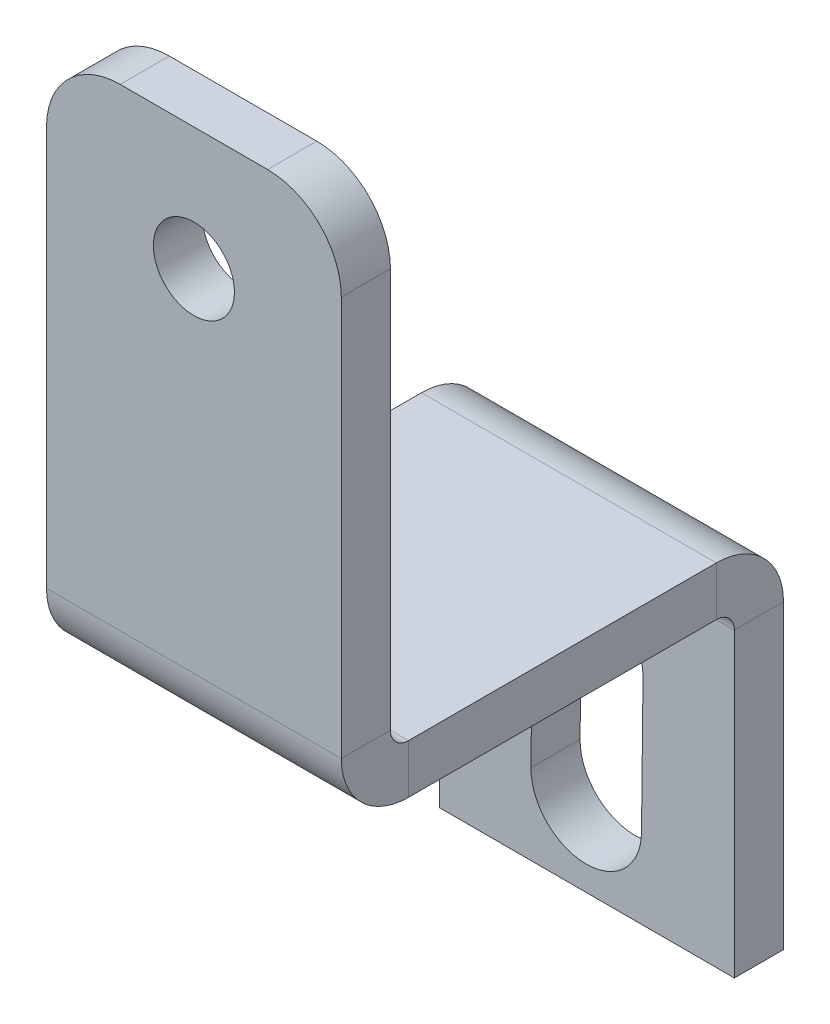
ISO-10303-21;
HEADER;
FILE_DESCRIPTION(('STEP AP214'),'2;1');
FILE_NAME('part.step','',(''),(''),'','','');
FILE_SCHEMA(('AUTOMOTIVE_DESIGN { 1 0 10303 214 1 1 1 1 }'));
ENDSEC;
DATA;
#1=APPLICATION_CONTEXT('core data for automotive mechanical design processes');
#2=APPLICATION_PROTOCOL_DEFINITION('international standard','automotive_design',2000,#1);
#3=PRODUCT_CONTEXT('',#1,'mechanical');
#4=PRODUCT('Part','Part','',(#3));
#5=PRODUCT_RELATED_PRODUCT_CATEGORY('part','',(#4));
#6=PRODUCT_DEFINITION_FORMATION('','',#4);
#7=PRODUCT_DEFINITION_CONTEXT('part definition',#1,'design');
#8=PRODUCT_DEFINITION('design','',#6,#7);
#9=PRODUCT_DEFINITION_SHAPE('','',#8);
#10=(LENGTH_UNIT() NAMED_UNIT(*) SI_UNIT(.MILLI.,.METRE.));
#11=(NAMED_UNIT(*) PLANE_ANGLE_UNIT() SI_UNIT($,.RADIAN.));
#12=(NAMED_UNIT(*) SI_UNIT($,.STERADIAN.) SOLID_ANGLE_UNIT());
#13=UNCERTAINTY_MEASURE_WITH_UNIT(LENGTH_MEASURE(1.E-05),#10,'distance_accuracy_value','');
#14=(GEOMETRIC_REPRESENTATION_CONTEXT(3) GLOBAL_UNCERTAINTY_ASSIGNED_CONTEXT((#13)) GLOBAL_UNIT_ASSIGNED_CONTEXT((#10,
#11,#12)) REPRESENTATION_CONTEXT('',''));
#15=CARTESIAN_POINT('',(0.,0.,0.));
#16=DIRECTION('',(0.,0.,1.));
#17=DIRECTION('',(1.,0.,0.));
#18=AXIS2_PLACEMENT_3D('',#15,#16,#17);
#19=CARTESIAN_POINT('',(-32.4679437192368,11.6094189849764,0.));
#20=DIRECTION('',(-1.,0.,0.));
#21=DIRECTION('',(0.,0.,1.));
#22=AXIS2_PLACEMENT_3D('',#19,#20,#21);
#23=PLANE('',#22);
#24=DIRECTION('',(0.,-1.,0.));
#25=VECTOR('',#24,1.);
#26=CARTESIAN_POINT('',(-32.4679437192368,11.6094189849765,13.2634));
#27=LINE('',#26,#25);
#28=CARTESIAN_POINT('',(-32.4679437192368,11.6094189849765,13.2634));
#29=VERTEX_POINT('',#28);
#30=CARTESIAN_POINT('',(-32.4679437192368,9.60941898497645,13.2634));
#31=VERTEX_POINT('',#30);
#32=EDGE_CURVE('E213',#29,#31,#27,.T.);
#33=ORIENTED_EDGE('',*,*,#32,.T.);
#34=DIRECTION('',(0.,0.,1.));
#35=VECTOR('',#34,1.);
#36=CARTESIAN_POINT('',(-32.4679437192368,9.6094189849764,0.));
#37=LINE('',#36,#35);
#38=CARTESIAN_POINT('',(-32.4679437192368,9.6094189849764,0.7366));
#39=VERTEX_POINT('',#38);
#40=EDGE_CURVE('E238',#31,#39,#37,.F.);
#41=ORIENTED_EDGE('',*,*,#40,.T.);
#42=DIRECTION('',(0.,-1.,0.));
#43=VECTOR('',#42,1.);
#44=CARTESIAN_POINT('',(-32.4679437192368,11.6094189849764,0.73659999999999));
#45=LINE('',#44,#43);
#46=CARTESIAN_POINT('',(-32.4679437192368,11.6094189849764,0.73659999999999));
#47=VERTEX_POINT('',#46);
#48=EDGE_CURVE('E226',#39,#47,#45,.F.);
#49=ORIENTED_EDGE('',*,*,#48,.T.);
#50=DIRECTION('',(0.,0.,-1.));
#51=VECTOR('',#50,1.);
#52=CARTESIAN_POINT('',(-32.4679437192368,11.6094189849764,0.));
#53=LINE('',#52,#51);
#54=EDGE_CURVE('E233',#29,#47,#53,.T.);
#55=ORIENTED_EDGE('',*,*,#54,.F.);
#56=EDGE_LOOP('',(#33,#41,#49,#55));
#57=FACE_BOUND('',#56,.T.);
#58=ADVANCED_FACE('F16',(#57),#23,.F.);
#59=CARTESIAN_POINT('',(-44.4679437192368,11.6094189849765,16.));
#60=DIRECTION('',(1.,0.,0.));
#61=DIRECTION('',(0.,0.,-1.));
#62=AXIS2_PLACEMENT_3D('',#59,#60,#61);
#63=PLANE('',#62);
#64=DIRECTION('',(0.,-1.,0.));
#65=VECTOR('',#64,1.);
#66=CARTESIAN_POINT('',(-44.4679437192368,11.6094189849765,13.2634));
#67=LINE('',#66,#65);
#68=CARTESIAN_POINT('',(-44.4679437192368,11.6094189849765,13.2634));
#69=VERTEX_POINT('',#68);
#70=CARTESIAN_POINT('',(-44.4679437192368,9.60941898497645,13.2634));
#71=VERTEX_POINT('',#70);
#72=EDGE_CURVE('E223',#69,#71,#67,.T.);
#73=ORIENTED_EDGE('',*,*,#72,.F.);
#74=DIRECTION('',(0.,0.,1.));
#75=VECTOR('',#74,1.);
#76=CARTESIAN_POINT('',(-44.4679437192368,11.6094189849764,0.));
#77=LINE('',#76,#75);
#78=CARTESIAN_POINT('',(-44.4679437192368,11.6094189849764,0.73659999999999));
#79=VERTEX_POINT('',#78);
#80=EDGE_CURVE('E229',#79,#69,#77,.T.);
#81=ORIENTED_EDGE('',*,*,#80,.F.);
#82=DIRECTION('',(0.,-1.,0.));
#83=VECTOR('',#82,1.);
#84=CARTESIAN_POINT('',(-44.4679437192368,9.6094189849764,0.7366));
#85=LINE('',#84,#83);
#86=CARTESIAN_POINT('',(-44.4679437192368,9.6094189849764,0.7366));
#87=VERTEX_POINT('',#86);
#88=EDGE_CURVE('E243',#87,#79,#85,.F.);
#89=ORIENTED_EDGE('',*,*,#88,.F.);
#90=DIRECTION('',(0.,0.,-1.));
#91=VECTOR('',#90,1.);
#92=CARTESIAN_POINT('',(-44.4679437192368,9.60941898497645,16.));
#93=LINE('',#92,#91);
#94=EDGE_CURVE('E235',#87,#71,#93,.F.);
#95=ORIENTED_EDGE('',*,*,#94,.T.);
#96=EDGE_LOOP('',(#73,#81,#89,#95));
#97=FACE_BOUND('',#96,.T.);
#98=ADVANCED_FACE('F354',(#97),#63,.F.);
#99=CARTESIAN_POINT('',(0.,11.6094189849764,0.));
#100=DIRECTION('',(0.,-1.,0.));
#101=DIRECTION('',(0.,0.,-1.));
#102=AXIS2_PLACEMENT_3D('',#99,#100,#101);
#103=PLANE('',#102);
#104=DIRECTION('',(1.,0.,0.));
#105=VECTOR('',#104,1.);
#106=CARTESIAN_POINT('',(-32.4679437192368,11.6094189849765,13.2634));
#107=LINE('',#106,#105);
#108=EDGE_CURVE('E219',#29,#69,#107,.F.);
#109=ORIENTED_EDGE('',*,*,#108,.F.);
#110=ORIENTED_EDGE('',*,*,#54,.T.);
#111=DIRECTION('',(-1.,0.,0.));
#112=VECTOR('',#111,1.);
#113=CARTESIAN_POINT('',(-32.4679437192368,11.6094189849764,0.73659999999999));
#114=LINE('',#113,#112);
#115=EDGE_CURVE('E240',#79,#47,#114,.F.);
#116=ORIENTED_EDGE('',*,*,#115,.F.);
#117=ORIENTED_EDGE('',*,*,#80,.T.);
#118=EDGE_LOOP('',(#109,#110,#116,#117));
#119=FACE_BOUND('',#118,.T.);
#120=ADVANCED_FACE('F362',(#119),#103,.F.);
#121=CARTESIAN_POINT('',(0.,9.6094189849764,0.));
#122=DIRECTION('',(0.,-1.,0.));
#123=DIRECTION('',(0.,0.,-1.));
#124=AXIS2_PLACEMENT_3D('',#121,#122,#123);
#125=PLANE('',#124);
#126=ORIENTED_EDGE('',*,*,#40,.F.);
#127=DIRECTION('',(1.,0.,0.));
#128=VECTOR('',#127,1.);
#129=CARTESIAN_POINT('',(-32.4679437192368,9.60941898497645,13.2634));
#130=LINE('',#129,#128);
#131=EDGE_CURVE('E206',#31,#71,#130,.F.);
#132=ORIENTED_EDGE('',*,*,#131,.T.);
#133=ORIENTED_EDGE('',*,*,#94,.F.);
#134=DIRECTION('',(-1.,0.,0.));
#135=VECTOR('',#134,1.);
#136=CARTESIAN_POINT('',(-32.4679437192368,9.6094189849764,0.7366));
#137=LINE('',#136,#135);
#138=EDGE_CURVE('E246',#39,#87,#137,.T.);
#139=ORIENTED_EDGE('',*,*,#138,.F.);
#140=EDGE_LOOP('',(#126,#132,#133,#139));
#141=FACE_BOUND('',#140,.T.);
#142=ADVANCED_FACE('F351',(#141),#125,.T.);
#143=CARTESIAN_POINT('',(-44.4679437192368,11.6094189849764,-2.));
#144=DIRECTION('',(-1.,0.,0.));
#145=DIRECTION('',(0.,0.,1.));
#146=AXIS2_PLACEMENT_3D('',#143,#144,#145);
#147=PLANE('',#146);
#148=DIRECTION('',(0.,-1.,0.));
#149=VECTOR('',#148,1.);
#150=CARTESIAN_POINT('',(-44.4679437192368,11.6094189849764,0.));
#151=LINE('',#150,#149);
#152=CARTESIAN_POINT('',(-44.4679437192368,8.8728189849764,0.));
#153=VERTEX_POINT('',#152);
#154=CARTESIAN_POINT('',(-44.4679437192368,-3.3905810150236,0.));
#155=VERTEX_POINT('',#154);
#156=EDGE_CURVE('E270',#153,#155,#151,.T.);
#157=ORIENTED_EDGE('',*,*,#156,.F.);
#158=DIRECTION('',(0.,0.,-1.));
#159=VECTOR('',#158,1.);
#160=CARTESIAN_POINT('',(-44.4679437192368,8.8728189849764,0.));
#161=LINE('',#160,#159);
#162=CARTESIAN_POINT('',(-44.4679437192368,8.8728189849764,-2.));
#163=VERTEX_POINT('',#162);
#164=EDGE_CURVE('E256',#153,#163,#161,.T.);
#165=ORIENTED_EDGE('',*,*,#164,.T.);
#166=DIRECTION('',(0.,-1.,0.));
#167=VECTOR('',#166,1.);
#168=CARTESIAN_POINT('',(-44.4679437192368,11.6094189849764,-2.));
#169=LINE('',#168,#167);
#170=CARTESIAN_POINT('',(-44.4679437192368,-3.3905810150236,-2.));
#171=VERTEX_POINT('',#170);
#172=EDGE_CURVE('E273',#163,#171,#169,.T.);
#173=ORIENTED_EDGE('',*,*,#172,.T.);
#174=DIRECTION('',(0.,0.,1.));
#175=VECTOR('',#174,1.);
#176=CARTESIAN_POINT('',(-44.4679437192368,-3.3905810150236,-2.));
#177=LINE('',#176,#175);
#178=EDGE_CURVE('E282',#171,#155,#177,.T.);
#179=ORIENTED_EDGE('',*,*,#178,.T.);
#180=EDGE_LOOP('',(#157,#165,#173,#179));
#181=FACE_BOUND('',#180,.T.);
#182=ADVANCED_FACE('F409',(#181),#147,.T.);
#183=CARTESIAN_POINT('',(0.,0.,-2.));
#184=DIRECTION('',(0.,0.,1.));
#185=DIRECTION('',(1.,0.,0.));
#186=AXIS2_PLACEMENT_3D('',#183,#184,#185);
#187=PLANE('',#186);
#188=CARTESIAN_POINT('',(-38.4370642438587,5.35924560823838,-2.));
#189=DIRECTION('',(0.,0.,1.));
#190=DIRECTION('',(1.,0.,0.));
#191=AXIS2_PLACEMENT_3D('',#188,#189,#190);
#192=CIRCLE('',#191,2.25);
#193=CARTESIAN_POINT('',(-36.1872060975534,5.33398058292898,-2.));
#194=VERTEX_POINT('',#193);
#195=CARTESIAN_POINT('',(-40.6869223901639,5.38451063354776,-2.));
#196=VERTEX_POINT('',#195);
#197=EDGE_CURVE('E169',#194,#196,#192,.T.);
#198=ORIENTED_EDGE('',*,*,#197,.T.);
#199=DIRECTION('',(0.011228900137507,0.999936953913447,0.));
#200=VECTOR('',#199,1.);
#201=CARTESIAN_POINT('',(-40.7486813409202,-0.115142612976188,-2.));
#202=LINE('',#201,#200);
#203=CARTESIAN_POINT('',(-40.7486813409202,-0.115142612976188,-2.));
#204=VERTEX_POINT('',#203);
#205=EDGE_CURVE('E150',#204,#196,#202,.T.);
#206=ORIENTED_EDGE('',*,*,#205,.F.);
#207=CARTESIAN_POINT('',(-38.4988231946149,-0.140407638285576,-2.));
#208=DIRECTION('',(0.,0.,1.));
#209=DIRECTION('',(1.,0.,0.));
#210=AXIS2_PLACEMENT_3D('',#207,#208,#209);
#211=CIRCLE('',#210,2.25);
#212=CARTESIAN_POINT('',(-36.2489650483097,-0.165672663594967,-2.));
#213=VERTEX_POINT('',#212);
#214=EDGE_CURVE('E154',#204,#213,#211,.T.);
#215=ORIENTED_EDGE('',*,*,#214,.T.);
#216=DIRECTION('',(0.011228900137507,0.999936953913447,0.));
#217=VECTOR('',#216,1.);
#218=CARTESIAN_POINT('',(-36.2489650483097,-0.165672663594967,-2.));
#219=LINE('',#218,#217);
#220=EDGE_CURVE('E686',#213,#194,#219,.T.);
#221=ORIENTED_EDGE('',*,*,#220,.T.);
#222=EDGE_LOOP('',(#198,#206,#215,#221));
#223=FACE_BOUND('',#222,.T.);
#224=DIRECTION('',(-1.,0.,0.));
#225=VECTOR('',#224,1.);
#226=CARTESIAN_POINT('',(-44.4679437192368,8.8728189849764,-2.));
#227=LINE('',#226,#225);
#228=CARTESIAN_POINT('',(-32.4679437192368,8.87281898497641,-2.));
#229=VERTEX_POINT('',#228);
#230=EDGE_CURVE('E250',#163,#229,#227,.F.);
#231=ORIENTED_EDGE('',*,*,#230,.T.);
#232=DIRECTION('',(0.,1.,0.));
#233=VECTOR('',#232,1.);
#234=CARTESIAN_POINT('',(-32.4679437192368,11.6094189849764,-2.));
#235=LINE('',#234,#233);
#236=CARTESIAN_POINT('',(-32.4679437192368,-3.3905810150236,-2.));
#237=VERTEX_POINT('',#236);
#238=EDGE_CURVE('E279',#237,#229,#235,.T.);
#239=ORIENTED_EDGE('',*,*,#238,.F.);
#240=DIRECTION('',(1.,0.,0.));
#241=VECTOR('',#240,1.);
#242=CARTESIAN_POINT('',(-44.4679437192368,-3.3905810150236,-2.));
#243=LINE('',#242,#241);
#244=EDGE_CURVE('E275',#171,#237,#243,.T.);
#245=ORIENTED_EDGE('',*,*,#244,.F.);
#246=ORIENTED_EDGE('',*,*,#172,.F.);
#247=EDGE_LOOP('',(#231,#239,#245,#246));
#248=FACE_BOUND('',#247,.T.);
#249=ADVANCED_FACE('F406',(#223,#248),#187,.F.);
#250=CARTESIAN_POINT('',(0.,0.,0.));
#251=DIRECTION('',(0.,0.,1.));
#252=DIRECTION('',(1.,0.,0.));
#253=AXIS2_PLACEMENT_3D('',#250,#251,#252);
#254=PLANE('',#253);
#255=DIRECTION('',(0.011228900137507,0.999936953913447,0.));
#256=VECTOR('',#255,1.);
#257=CARTESIAN_POINT('',(-40.7486813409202,-0.115142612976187,0.));
#258=LINE('',#257,#256);
#259=CARTESIAN_POINT('',(-40.7486813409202,-0.115142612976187,0.));
#260=VERTEX_POINT('',#259);
#261=CARTESIAN_POINT('',(-40.6869223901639,5.38451063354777,0.));
#262=VERTEX_POINT('',#261);
#263=EDGE_CURVE('E141',#260,#262,#258,.T.);
#264=ORIENTED_EDGE('',*,*,#263,.T.);
#265=CARTESIAN_POINT('',(-38.4370642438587,5.35924560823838,0.));
#266=DIRECTION('',(0.,0.,1.));
#267=DIRECTION('',(1.,0.,0.));
#268=AXIS2_PLACEMENT_3D('',#265,#266,#267);
#269=CIRCLE('',#268,2.25);
#270=CARTESIAN_POINT('',(-36.1872060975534,5.33398058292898,0.));
#271=VERTEX_POINT('',#270);
#272=EDGE_CURVE('E156',#271,#262,#269,.T.);
#273=ORIENTED_EDGE('',*,*,#272,.F.);
#274=DIRECTION('',(0.011228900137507,0.999936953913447,0.));
#275=VECTOR('',#274,1.);
#276=CARTESIAN_POINT('',(-36.2489650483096,-0.165672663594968,0.));
#277=LINE('',#276,#275);
#278=CARTESIAN_POINT('',(-36.2489650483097,-0.165672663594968,0.));
#279=VERTEX_POINT('',#278);
#280=EDGE_CURVE('E162',#279,#271,#277,.T.);
#281=ORIENTED_EDGE('',*,*,#280,.F.);
#282=CARTESIAN_POINT('',(-38.4988231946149,-0.140407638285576,0.));
#283=DIRECTION('',(0.,0.,1.));
#284=DIRECTION('',(1.,0.,0.));
#285=AXIS2_PLACEMENT_3D('',#282,#283,#284);
#286=CIRCLE('',#285,2.25);
#287=EDGE_CURVE('E39',#260,#279,#286,.T.);
#288=ORIENTED_EDGE('',*,*,#287,.F.);
#289=EDGE_LOOP('',(#264,#273,#281,#288));
#290=FACE_BOUND('',#289,.T.);
#291=DIRECTION('',(0.,1.,0.));
#292=VECTOR('',#291,1.);
#293=CARTESIAN_POINT('',(-32.4679437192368,11.6094189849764,0.));
#294=LINE('',#293,#292);
#295=CARTESIAN_POINT('',(-32.4679437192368,-3.3905810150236,0.));
#296=VERTEX_POINT('',#295);
#297=CARTESIAN_POINT('',(-32.4679437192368,8.8728189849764,0.));
#298=VERTEX_POINT('',#297);
#299=EDGE_CURVE('E276',#296,#298,#294,.T.);
#300=ORIENTED_EDGE('',*,*,#299,.T.);
#301=DIRECTION('',(-1.,0.,0.));
#302=VECTOR('',#301,1.);
#303=CARTESIAN_POINT('',(-44.4679437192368,8.8728189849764,0.));
#304=LINE('',#303,#302);
#305=EDGE_CURVE('E262',#153,#298,#304,.F.);
#306=ORIENTED_EDGE('',*,*,#305,.F.);
#307=ORIENTED_EDGE('',*,*,#156,.T.);
#308=DIRECTION('',(1.,0.,0.));
#309=VECTOR('',#308,1.);
#310=CARTESIAN_POINT('',(-44.4679437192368,-3.3905810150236,0.));
#311=LINE('',#310,#309);
#312=EDGE_CURVE('E284',#155,#296,#311,.T.);
#313=ORIENTED_EDGE('',*,*,#312,.T.);
#314=EDGE_LOOP('',(#300,#306,#307,#313));
#315=FACE_BOUND('',#314,.T.);
#316=ADVANCED_FACE('F160',(#290,#315),#254,.T.);
#317=CARTESIAN_POINT('',(-32.4679437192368,11.6094189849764,-2.));
#318=DIRECTION('',(1.,0.,0.));
#319=DIRECTION('',(0.,0.,-1.));
#320=AXIS2_PLACEMENT_3D('',#317,#318,#319);
#321=PLANE('',#320);
#322=DIRECTION('',(0.,0.,-1.));
#323=VECTOR('',#322,1.);
#324=CARTESIAN_POINT('',(-32.4679437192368,8.8728189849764,0.));
#325=LINE('',#324,#323);
#326=EDGE_CURVE('E267',#298,#229,#325,.T.);
#327=ORIENTED_EDGE('',*,*,#326,.F.);
#328=ORIENTED_EDGE('',*,*,#299,.F.);
#329=DIRECTION('',(0.,0.,1.));
#330=VECTOR('',#329,1.);
#331=CARTESIAN_POINT('',(-32.4679437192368,-3.3905810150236,-2.));
#332=LINE('',#331,#330);
#333=EDGE_CURVE('E289',#237,#296,#332,.T.);
#334=ORIENTED_EDGE('',*,*,#333,.F.);
#335=ORIENTED_EDGE('',*,*,#238,.T.);
#336=EDGE_LOOP('',(#327,#328,#334,#335));
#337=FACE_BOUND('',#336,.T.);
#338=ADVANCED_FACE('F413',(#337),#321,.T.);
#339=CARTESIAN_POINT('',(-44.4679437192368,-3.3905810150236,-2.));
#340=DIRECTION('',(0.,-1.,0.));
#341=DIRECTION('',(0.,0.,-1.));
#342=AXIS2_PLACEMENT_3D('',#339,#340,#341);
#343=PLANE('',#342);
#344=ORIENTED_EDGE('',*,*,#312,.F.);
#345=ORIENTED_EDGE('',*,*,#178,.F.);
#346=ORIENTED_EDGE('',*,*,#244,.T.);
#347=ORIENTED_EDGE('',*,*,#333,.T.);
#348=EDGE_LOOP('',(#344,#345,#346,#347));
#349=FACE_BOUND('',#348,.T.);
#350=ADVANCED_FACE('F403',(#349),#343,.T.);
#351=CARTESIAN_POINT('',(-32.4679437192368,8.8728189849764,0.7366));
#352=DIRECTION('',(1.,0.,0.));
#353=DIRECTION('',(0.,0.,-1.));
#354=AXIS2_PLACEMENT_3D('',#351,#352,#353);
#355=PLANE('',#354);
#356=ORIENTED_EDGE('',*,*,#48,.F.);
#357=CARTESIAN_POINT('',(-32.4679437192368,8.8728189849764,0.7366));
#358=DIRECTION('',(-1.,0.,0.));
#359=DIRECTION('',(0.,0.,1.));
#360=AXIS2_PLACEMENT_3D('',#357,#358,#359);
#361=CIRCLE('',#360,0.7366);
#362=EDGE_CURVE('E259',#298,#39,#361,.F.);
#363=ORIENTED_EDGE('',*,*,#362,.F.);
#364=ORIENTED_EDGE('',*,*,#326,.T.);
#365=CARTESIAN_POINT('',(-32.4679437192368,8.8728189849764,0.7366));
#366=DIRECTION('',(-1.,0.,0.));
#367=DIRECTION('',(0.,0.,1.));
#368=AXIS2_PLACEMENT_3D('',#365,#366,#367);
#369=CIRCLE('',#368,2.7366);
#370=EDGE_CURVE('E252',#229,#47,#369,.F.);
#371=ORIENTED_EDGE('',*,*,#370,.T.);
#372=EDGE_LOOP('',(#356,#363,#364,#371));
#373=FACE_BOUND('',#372,.T.);
#374=ADVANCED_FACE('F370',(#373),#355,.T.);
#375=CARTESIAN_POINT('',(-44.4679437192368,8.8728189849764,0.7366));
#376=DIRECTION('',(1.,0.,0.));
#377=DIRECTION('',(0.,0.,-1.));
#378=AXIS2_PLACEMENT_3D('',#375,#376,#377);
#379=PLANE('',#378);
#380=CARTESIAN_POINT('',(-44.4679437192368,8.8728189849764,0.7366));
#381=DIRECTION('',(-1.,0.,0.));
#382=DIRECTION('',(0.,0.,1.));
#383=AXIS2_PLACEMENT_3D('',#380,#381,#382);
#384=CIRCLE('',#383,0.7366);
#385=EDGE_CURVE('E232',#87,#153,#384,.T.);
#386=ORIENTED_EDGE('',*,*,#385,.F.);
#387=ORIENTED_EDGE('',*,*,#88,.T.);
#388=CARTESIAN_POINT('',(-44.4679437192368,8.8728189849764,0.7366));
#389=DIRECTION('',(-1.,0.,0.));
#390=DIRECTION('',(0.,0.,1.));
#391=AXIS2_PLACEMENT_3D('',#388,#389,#390);
#392=CIRCLE('',#391,2.7366);
#393=EDGE_CURVE('E253',#79,#163,#392,.T.);
#394=ORIENTED_EDGE('',*,*,#393,.T.);
#395=ORIENTED_EDGE('',*,*,#164,.F.);
#396=EDGE_LOOP('',(#386,#387,#394,#395));
#397=FACE_BOUND('',#396,.T.);
#398=ADVANCED_FACE('F358',(#397),#379,.F.);
#399=CARTESIAN_POINT('',(-44.4679437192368,8.8728189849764,0.7366));
#400=DIRECTION('',(-1.,0.,0.));
#401=DIRECTION('',(0.,1.,0.));
#402=AXIS2_PLACEMENT_3D('',#399,#400,#401);
#403=CYLINDRICAL_SURFACE('',#402,2.7366);
#404=ORIENTED_EDGE('',*,*,#230,.F.);
#405=ORIENTED_EDGE('',*,*,#393,.F.);
#406=ORIENTED_EDGE('',*,*,#115,.T.);
#407=ORIENTED_EDGE('',*,*,#370,.F.);
#408=EDGE_LOOP('',(#404,#405,#406,#407));
#409=FACE_BOUND('',#408,.T.);
#410=ADVANCED_FACE('F367',(#409),#403,.T.);
#411=CARTESIAN_POINT('',(-44.4679437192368,8.8728189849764,0.7366));
#412=DIRECTION('',(-1.,0.,0.));
#413=DIRECTION('',(0.,1.,0.));
#414=AXIS2_PLACEMENT_3D('',#411,#412,#413);
#415=CYLINDRICAL_SURFACE('',#414,0.7366);
#416=ORIENTED_EDGE('',*,*,#305,.T.);
#417=ORIENTED_EDGE('',*,*,#362,.T.);
#418=ORIENTED_EDGE('',*,*,#138,.T.);
#419=ORIENTED_EDGE('',*,*,#385,.T.);
#420=EDGE_LOOP('',(#416,#417,#418,#419));
#421=FACE_BOUND('',#420,.T.);
#422=ADVANCED_FACE('F397',(#421),#415,.F.);
#423=CARTESIAN_POINT('',(-44.4679437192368,12.3460189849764,13.2634));
#424=DIRECTION('',(-1.,0.,0.));
#425=DIRECTION('',(0.,0.,1.));
#426=AXIS2_PLACEMENT_3D('',#423,#424,#425);
#427=PLANE('',#426);
#428=DIRECTION('',(0.,0.,-1.));
#429=VECTOR('',#428,1.);
#430=CARTESIAN_POINT('',(-44.4679437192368,12.3460189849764,16.));
#431=LINE('',#430,#429);
#432=CARTESIAN_POINT('',(-44.4679437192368,12.3460189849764,14.));
#433=VERTEX_POINT('',#432);
#434=CARTESIAN_POINT('',(-44.4679437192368,12.3460189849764,16.));
#435=VERTEX_POINT('',#434);
#436=EDGE_CURVE('E203',#433,#435,#431,.F.);
#437=ORIENTED_EDGE('',*,*,#436,.F.);
#438=CARTESIAN_POINT('',(-44.4679437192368,12.3460189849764,13.2634));
#439=DIRECTION('',(1.,0.,0.));
#440=DIRECTION('',(0.,0.,-1.));
#441=AXIS2_PLACEMENT_3D('',#438,#439,#440);
#442=CIRCLE('',#441,0.736599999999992);
#443=EDGE_CURVE('E216',#69,#433,#442,.F.);
#444=ORIENTED_EDGE('',*,*,#443,.F.);
#445=ORIENTED_EDGE('',*,*,#72,.T.);
#446=CARTESIAN_POINT('',(-44.4679437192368,12.3460189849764,13.2634));
#447=DIRECTION('',(1.,0.,0.));
#448=DIRECTION('',(0.,0.,-1.));
#449=AXIS2_PLACEMENT_3D('',#446,#447,#448);
#450=CIRCLE('',#449,2.7366);
#451=EDGE_CURVE('E209',#71,#435,#450,.F.);
#452=ORIENTED_EDGE('',*,*,#451,.T.);
#453=EDGE_LOOP('',(#437,#444,#445,#452));
#454=FACE_BOUND('',#453,.T.);
#455=ADVANCED_FACE('F343',(#454),#427,.T.);
#456=CARTESIAN_POINT('',(-32.4679437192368,12.3460189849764,13.2634));
#457=DIRECTION('',(-1.,0.,0.));
#458=DIRECTION('',(0.,0.,1.));
#459=AXIS2_PLACEMENT_3D('',#456,#457,#458);
#460=PLANE('',#459);
#461=CARTESIAN_POINT('',(-32.4679437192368,12.3460189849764,13.2634));
#462=DIRECTION('',(1.,0.,0.));
#463=DIRECTION('',(0.,0.,-1.));
#464=AXIS2_PLACEMENT_3D('',#461,#462,#463);
#465=CIRCLE('',#464,0.736599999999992);
#466=CARTESIAN_POINT('',(-32.4679437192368,12.3460189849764,14.));
#467=VERTEX_POINT('',#466);
#468=EDGE_CURVE('E181',#467,#29,#465,.T.);
#469=ORIENTED_EDGE('',*,*,#468,.F.);
#470=DIRECTION('',(0.,0.,-1.));
#471=VECTOR('',#470,1.);
#472=CARTESIAN_POINT('',(-32.4679437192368,12.3460189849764,14.));
#473=LINE('',#472,#471);
#474=CARTESIAN_POINT('',(-32.4679437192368,12.3460189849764,16.));
#475=VERTEX_POINT('',#474);
#476=EDGE_CURVE('E198',#467,#475,#473,.F.);
#477=ORIENTED_EDGE('',*,*,#476,.T.);
#478=CARTESIAN_POINT('',(-32.4679437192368,12.3460189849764,13.2634));
#479=DIRECTION('',(1.,0.,0.));
#480=DIRECTION('',(0.,0.,-1.));
#481=AXIS2_PLACEMENT_3D('',#478,#479,#480);
#482=CIRCLE('',#481,2.7366);
#483=EDGE_CURVE('E210',#475,#31,#482,.T.);
#484=ORIENTED_EDGE('',*,*,#483,.T.);
#485=ORIENTED_EDGE('',*,*,#32,.F.);
#486=EDGE_LOOP('',(#469,#477,#484,#485));
#487=FACE_BOUND('',#486,.T.);
#488=ADVANCED_FACE('F339',(#487),#460,.F.);
#489=CARTESIAN_POINT('',(-32.4679437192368,12.3460189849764,13.2634));
#490=DIRECTION('',(1.,0.,0.));
#491=DIRECTION('',(0.,0.,1.));
#492=AXIS2_PLACEMENT_3D('',#489,#490,#491);
#493=CYLINDRICAL_SURFACE('',#492,2.7366);
#494=ORIENTED_EDGE('',*,*,#131,.F.);
#495=ORIENTED_EDGE('',*,*,#483,.F.);
#496=DIRECTION('',(1.,0.,0.));
#497=VECTOR('',#496,1.);
#498=CARTESIAN_POINT('',(-44.4679437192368,12.3460189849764,16.));
#499=LINE('',#498,#497);
#500=EDGE_CURVE('E195',#475,#435,#499,.F.);
#501=ORIENTED_EDGE('',*,*,#500,.T.);
#502=ORIENTED_EDGE('',*,*,#451,.F.);
#503=EDGE_LOOP('',(#494,#495,#501,#502));
#504=FACE_BOUND('',#503,.T.);
#505=ADVANCED_FACE('F341',(#504),#493,.T.);
#506=CARTESIAN_POINT('',(-32.4679437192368,12.3460189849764,13.2634));
#507=DIRECTION('',(1.,0.,0.));
#508=DIRECTION('',(0.,0.,1.));
#509=AXIS2_PLACEMENT_3D('',#506,#507,#508);
#510=CYLINDRICAL_SURFACE('',#509,0.736599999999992);
#511=ORIENTED_EDGE('',*,*,#108,.T.);
#512=ORIENTED_EDGE('',*,*,#443,.T.);
#513=DIRECTION('',(1.,0.,0.));
#514=VECTOR('',#513,1.);
#515=CARTESIAN_POINT('',(-44.4679437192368,12.3460189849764,14.));
#516=LINE('',#515,#514);
#517=EDGE_CURVE('E201',#433,#467,#516,.T.);
#518=ORIENTED_EDGE('',*,*,#517,.T.);
#519=ORIENTED_EDGE('',*,*,#468,.T.);
#520=EDGE_LOOP('',(#511,#512,#518,#519));
#521=FACE_BOUND('',#520,.T.);
#522=ADVANCED_FACE('F374',(#521),#510,.F.);
#523=CARTESIAN_POINT('',(-44.4679437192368,11.6094189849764,16.));
#524=DIRECTION('',(1.,0.,0.));
#525=DIRECTION('',(0.,0.,-1.));
#526=AXIS2_PLACEMENT_3D('',#523,#524,#525);
#527=PLANE('',#526);
#528=DIRECTION('',(0.,-1.,0.));
#529=VECTOR('',#528,1.);
#530=CARTESIAN_POINT('',(-44.4679437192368,0.,16.));
#531=LINE('',#530,#529);
#532=CARTESIAN_POINT('',(-44.4679437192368,28.6094189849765,16.));
#533=VERTEX_POINT('',#532);
#534=EDGE_CURVE('E185',#533,#435,#531,.T.);
#535=ORIENTED_EDGE('',*,*,#534,.F.);
#536=DIRECTION('',(0.,0.,-1.));
#537=VECTOR('',#536,1.);
#538=CARTESIAN_POINT('',(-44.4679437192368,28.6094189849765,16.));
#539=LINE('',#538,#537);
#540=CARTESIAN_POINT('',(-44.4679437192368,28.6094189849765,14.));
#541=VERTEX_POINT('',#540);
#542=EDGE_CURVE('E291',#533,#541,#539,.T.);
#543=ORIENTED_EDGE('',*,*,#542,.T.);
#544=DIRECTION('',(0.,1.,0.));
#545=VECTOR('',#544,1.);
#546=CARTESIAN_POINT('',(-44.4679437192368,11.6094189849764,14.));
#547=LINE('',#546,#545);
#548=EDGE_CURVE('E193',#541,#433,#547,.F.);
#549=ORIENTED_EDGE('',*,*,#548,.T.);
#550=ORIENTED_EDGE('',*,*,#436,.T.);
#551=EDGE_LOOP('',(#535,#543,#549,#550));
#552=FACE_BOUND('',#551,.T.);
#553=ADVANCED_FACE('F318',(#552),#527,.F.);
#554=CARTESIAN_POINT('',(-32.4679437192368,31.6094189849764,16.));
#555=DIRECTION('',(-1.,0.,0.));
#556=DIRECTION('',(0.,0.,1.));
#557=AXIS2_PLACEMENT_3D('',#554,#555,#556);
#558=PLANE('',#557);
#559=DIRECTION('',(0.,-1.,0.));
#560=VECTOR('',#559,1.);
#561=CARTESIAN_POINT('',(-32.4679437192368,31.6094189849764,14.));
#562=LINE('',#561,#560);
#563=CARTESIAN_POINT('',(-32.4679437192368,28.6094189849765,14.));
#564=VERTEX_POINT('',#563);
#565=EDGE_CURVE('E190',#467,#564,#562,.F.);
#566=ORIENTED_EDGE('',*,*,#565,.T.);
#567=DIRECTION('',(0.,0.,-1.));
#568=VECTOR('',#567,1.);
#569=CARTESIAN_POINT('',(-32.4679437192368,28.6094189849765,16.));
#570=LINE('',#569,#568);
#571=CARTESIAN_POINT('',(-32.4679437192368,28.6094189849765,16.));
#572=VERTEX_POINT('',#571);
#573=EDGE_CURVE('E11',#564,#572,#570,.F.);
#574=ORIENTED_EDGE('',*,*,#573,.T.);
#575=DIRECTION('',(0.,1.,0.));
#576=VECTOR('',#575,1.);
#577=CARTESIAN_POINT('',(-32.4679437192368,0.,16.));
#578=LINE('',#577,#576);
#579=EDGE_CURVE('E182',#475,#572,#578,.T.);
#580=ORIENTED_EDGE('',*,*,#579,.F.);
#581=ORIENTED_EDGE('',*,*,#476,.F.);
#582=EDGE_LOOP('',(#566,#574,#580,#581));
#583=FACE_BOUND('',#582,.T.);
#584=ADVANCED_FACE('F335',(#583),#558,.F.);
#585=CARTESIAN_POINT('',(0.,0.,16.));
#586=DIRECTION('',(0.,0.,-1.));
#587=DIRECTION('',(-1.,0.,0.));
#588=AXIS2_PLACEMENT_3D('',#585,#586,#587);
#589=PLANE('',#588);
#590=CARTESIAN_POINT('',(-38.4679437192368,26.6094189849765,16.));
#591=DIRECTION('',(0.,0.,1.));
#592=DIRECTION('',(1.,0.,0.));
#593=AXIS2_PLACEMENT_3D('',#590,#591,#592);
#594=CIRCLE('',#593,1.65);
#595=CARTESIAN_POINT('',(-36.8179437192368,26.6094189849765,16.));
#596=VERTEX_POINT('',#595);
#597=EDGE_CURVE('E174',#596,#596,#594,.T.);
#598=ORIENTED_EDGE('',*,*,#597,.F.);
#599=EDGE_LOOP('',(#598));
#600=FACE_BOUND('',#599,.T.);
#601=DIRECTION('',(-1.,0.,0.));
#602=VECTOR('',#601,1.);
#603=CARTESIAN_POINT('',(0.,31.6094189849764,16.));
#604=LINE('',#603,#602);
#605=CARTESIAN_POINT('',(-35.4679437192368,31.6094189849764,16.));
#606=VERTEX_POINT('',#605);
#607=CARTESIAN_POINT('',(-41.4679437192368,31.6094189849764,16.));
#608=VERTEX_POINT('',#607);
#609=EDGE_CURVE('E178',#606,#608,#604,.T.);
#610=ORIENTED_EDGE('',*,*,#609,.T.);
#611=CARTESIAN_POINT('',(-41.4679437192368,28.6094189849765,16.));
#612=DIRECTION('',(0.,0.,-1.));
#613=DIRECTION('',(-1.,0.,0.));
#614=AXIS2_PLACEMENT_3D('',#611,#612,#613);
#615=CIRCLE('',#614,3.);
#616=EDGE_CURVE('E24',#608,#533,#615,.F.);
#617=ORIENTED_EDGE('',*,*,#616,.T.);
#618=ORIENTED_EDGE('',*,*,#534,.T.);
#619=ORIENTED_EDGE('',*,*,#500,.F.);
#620=ORIENTED_EDGE('',*,*,#579,.T.);
#621=CARTESIAN_POINT('',(-35.4679437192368,28.6094189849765,16.));
#622=DIRECTION('',(0.,0.,-1.));
#623=DIRECTION('',(-1.,0.,0.));
#624=AXIS2_PLACEMENT_3D('',#621,#622,#623);
#625=CIRCLE('',#624,3.);
#626=EDGE_CURVE('E307',#572,#606,#625,.F.);
#627=ORIENTED_EDGE('',*,*,#626,.T.);
#628=EDGE_LOOP('',(#610,#617,#618,#619,#620,#627));
#629=FACE_BOUND('',#628,.T.);
#630=ADVANCED_FACE('F311',(#600,#629),#589,.F.);
#631=CARTESIAN_POINT('',(0.,0.,14.));
#632=DIRECTION('',(0.,0.,-1.));
#633=DIRECTION('',(-1.,0.,0.));
#634=AXIS2_PLACEMENT_3D('',#631,#632,#633);
#635=PLANE('',#634);
#636=CARTESIAN_POINT('',(-38.4679437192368,26.6094189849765,14.));
#637=DIRECTION('',(0.,0.,-1.));
#638=DIRECTION('',(-1.,0.,0.));
#639=AXIS2_PLACEMENT_3D('',#636,#637,#638);
#640=CIRCLE('',#639,1.65);
#641=CARTESIAN_POINT('',(-40.1179437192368,26.6094189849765,14.));
#642=VERTEX_POINT('',#641);
#643=EDGE_CURVE('E177',#642,#642,#640,.T.);
#644=ORIENTED_EDGE('',*,*,#643,.F.);
#645=EDGE_LOOP('',(#644));
#646=FACE_BOUND('',#645,.T.);
#647=ORIENTED_EDGE('',*,*,#548,.F.);
#648=CARTESIAN_POINT('',(-41.4679437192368,28.6094189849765,14.));
#649=DIRECTION('',(0.,0.,-1.));
#650=DIRECTION('',(-1.,0.,0.));
#651=AXIS2_PLACEMENT_3D('',#648,#649,#650);
#652=CIRCLE('',#651,3.);
#653=CARTESIAN_POINT('',(-41.4679437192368,31.6094189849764,14.));
#654=VERTEX_POINT('',#653);
#655=EDGE_CURVE('E300',#541,#654,#652,.T.);
#656=ORIENTED_EDGE('',*,*,#655,.T.);
#657=DIRECTION('',(1.,0.,0.));
#658=VECTOR('',#657,1.);
#659=CARTESIAN_POINT('',(-44.4679437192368,31.6094189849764,14.));
#660=LINE('',#659,#658);
#661=CARTESIAN_POINT('',(-35.4679437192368,31.6094189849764,14.));
#662=VERTEX_POINT('',#661);
#663=EDGE_CURVE('E187',#662,#654,#660,.F.);
#664=ORIENTED_EDGE('',*,*,#663,.F.);
#665=CARTESIAN_POINT('',(-35.4679437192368,28.6094189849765,14.));
#666=DIRECTION('',(0.,0.,-1.));
#667=DIRECTION('',(-1.,0.,0.));
#668=AXIS2_PLACEMENT_3D('',#665,#666,#667);
#669=CIRCLE('',#668,3.);
#670=EDGE_CURVE('E298',#662,#564,#669,.T.);
#671=ORIENTED_EDGE('',*,*,#670,.T.);
#672=ORIENTED_EDGE('',*,*,#565,.F.);
#673=ORIENTED_EDGE('',*,*,#517,.F.);
#674=EDGE_LOOP('',(#647,#656,#664,#671,#672,#673));
#675=FACE_BOUND('',#674,.T.);
#676=ADVANCED_FACE('F324',(#646,#675),#635,.T.);
#677=CARTESIAN_POINT('',(-44.4679437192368,31.6094189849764,16.));
#678=DIRECTION('',(0.,-1.,0.));
#679=DIRECTION('',(0.,0.,-1.));
#680=AXIS2_PLACEMENT_3D('',#677,#678,#679);
#681=PLANE('',#680);
#682=ORIENTED_EDGE('',*,*,#663,.T.);
#683=DIRECTION('',(0.,0.,-1.));
#684=VECTOR('',#683,1.);
#685=CARTESIAN_POINT('',(-41.4679437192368,31.6094189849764,16.));
#686=LINE('',#685,#684);
#687=EDGE_CURVE('E305',#654,#608,#686,.F.);
#688=ORIENTED_EDGE('',*,*,#687,.T.);
#689=ORIENTED_EDGE('',*,*,#609,.F.);
#690=DIRECTION('',(0.,0.,-1.));
#691=VECTOR('',#690,1.);
#692=CARTESIAN_POINT('',(-35.4679437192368,31.6094189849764,16.));
#693=LINE('',#692,#691);
#694=EDGE_CURVE('E302',#606,#662,#693,.T.);
#695=ORIENTED_EDGE('',*,*,#694,.T.);
#696=EDGE_LOOP('',(#682,#688,#689,#695));
#697=FACE_BOUND('',#696,.T.);
#698=ADVANCED_FACE('F327',(#697),#681,.F.);
#699=CARTESIAN_POINT('',(-38.4679437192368,26.6094189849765,16.));
#700=DIRECTION('',(0.,0.,1.));
#701=DIRECTION('',(1.,0.,0.));
#702=AXIS2_PLACEMENT_3D('',#699,#700,#701);
#703=CYLINDRICAL_SURFACE('',#702,1.65);
#704=ORIENTED_EDGE('',*,*,#643,.T.);
#705=EDGE_LOOP('',(#704));
#706=FACE_BOUND('',#705,.T.);
#707=ORIENTED_EDGE('',*,*,#597,.T.);
#708=EDGE_LOOP('',(#707));
#709=FACE_BOUND('',#708,.T.);
#710=ADVANCED_FACE('F423',(#706,#709),#703,.F.);
#711=CARTESIAN_POINT('',(-41.4679437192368,28.6094189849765,16.));
#712=DIRECTION('',(0.,0.,-1.));
#713=DIRECTION('',(-1.,0.,0.));
#714=AXIS2_PLACEMENT_3D('',#711,#712,#713);
#715=CYLINDRICAL_SURFACE('',#714,3.);
#716=ORIENTED_EDGE('',*,*,#616,.F.);
#717=ORIENTED_EDGE('',*,*,#687,.F.);
#718=ORIENTED_EDGE('',*,*,#655,.F.);
#719=ORIENTED_EDGE('',*,*,#542,.F.);
#720=EDGE_LOOP('',(#716,#717,#718,#719));
#721=FACE_BOUND('',#720,.T.);
#722=ADVANCED_FACE('F321',(#721),#715,.T.);
#723=CARTESIAN_POINT('',(-35.4679437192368,28.6094189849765,16.));
#724=DIRECTION('',(0.,0.,-1.));
#725=DIRECTION('',(-1.,0.,0.));
#726=AXIS2_PLACEMENT_3D('',#723,#724,#725);
#727=CYLINDRICAL_SURFACE('',#726,3.);
#728=ORIENTED_EDGE('',*,*,#626,.F.);
#729=ORIENTED_EDGE('',*,*,#573,.F.);
#730=ORIENTED_EDGE('',*,*,#670,.F.);
#731=ORIENTED_EDGE('',*,*,#694,.F.);
#732=EDGE_LOOP('',(#728,#729,#730,#731));
#733=FACE_BOUND('',#732,.T.);
#734=ADVANCED_FACE('F18',(#733),#727,.T.);
#735=CARTESIAN_POINT('',(-38.4370642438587,5.35924560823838,0.));
#736=DIRECTION('',(0.,0.,1.));
#737=DIRECTION('',(1.,0.,0.));
#738=AXIS2_PLACEMENT_3D('',#735,#736,#737);
#739=CYLINDRICAL_SURFACE('',#738,2.25);
#740=ORIENTED_EDGE('',*,*,#197,.F.);
#741=DIRECTION('',(0.,0.,1.));
#742=VECTOR('',#741,1.);
#743=CARTESIAN_POINT('',(-36.1872060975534,5.33398058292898,0.));
#744=LINE('',#743,#742);
#745=EDGE_CURVE('E31',#271,#194,#744,.F.);
#746=ORIENTED_EDGE('',*,*,#745,.F.);
#747=ORIENTED_EDGE('',*,*,#272,.T.);
#748=DIRECTION('',(0.,0.,1.));
#749=VECTOR('',#748,1.);
#750=CARTESIAN_POINT('',(-40.6869223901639,5.38451063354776,0.));
#751=LINE('',#750,#749);
#752=EDGE_CURVE('E146',#196,#262,#751,.T.);
#753=ORIENTED_EDGE('',*,*,#752,.F.);
#754=EDGE_LOOP('',(#740,#746,#747,#753));
#755=FACE_BOUND('',#754,.T.);
#756=ADVANCED_FACE('F429',(#755),#739,.F.);
#757=CARTESIAN_POINT('',(-38.4988231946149,-0.140407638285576,0.));
#758=DIRECTION('',(0.,0.,1.));
#759=DIRECTION('',(1.,0.,0.));
#760=AXIS2_PLACEMENT_3D('',#757,#758,#759);
#761=CYLINDRICAL_SURFACE('',#760,2.25);
#762=ORIENTED_EDGE('',*,*,#287,.T.);
#763=DIRECTION('',(0.,0.,1.));
#764=VECTOR('',#763,1.);
#765=CARTESIAN_POINT('',(-36.2489650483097,-0.165672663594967,0.));
#766=LINE('',#765,#764);
#767=EDGE_CURVE('E157',#213,#279,#766,.T.);
#768=ORIENTED_EDGE('',*,*,#767,.F.);
#769=ORIENTED_EDGE('',*,*,#214,.F.);
#770=DIRECTION('',(0.,0.,1.));
#771=VECTOR('',#770,1.);
#772=CARTESIAN_POINT('',(-40.7486813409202,-0.115142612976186,0.));
#773=LINE('',#772,#771);
#774=EDGE_CURVE('E143',#260,#204,#773,.F.);
#775=ORIENTED_EDGE('',*,*,#774,.F.);
#776=EDGE_LOOP('',(#762,#768,#769,#775));
#777=FACE_BOUND('',#776,.T.);
#778=ADVANCED_FACE('F152',(#777),#761,.F.);
#779=CARTESIAN_POINT('',(-40.7486813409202,-0.115142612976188,0.));
#780=DIRECTION('',(-0.999936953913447,0.011228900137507,0.));
#781=DIRECTION('',(-0.011228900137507,-0.999936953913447,0.));
#782=AXIS2_PLACEMENT_3D('',#779,#780,#781);
#783=PLANE('',#782);
#784=ORIENTED_EDGE('',*,*,#752,.T.);
#785=ORIENTED_EDGE('',*,*,#263,.F.);
#786=ORIENTED_EDGE('',*,*,#774,.T.);
#787=ORIENTED_EDGE('',*,*,#205,.T.);
#788=EDGE_LOOP('',(#784,#785,#786,#787));
#789=FACE_BOUND('',#788,.T.);
#790=ADVANCED_FACE('F142',(#789),#783,.F.);
#791=CARTESIAN_POINT('',(-36.2489650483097,-0.165672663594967,0.));
#792=DIRECTION('',(0.999936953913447,-0.011228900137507,0.));
#793=DIRECTION('',(0.011228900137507,0.999936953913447,0.));
#794=AXIS2_PLACEMENT_3D('',#791,#792,#793);
#795=PLANE('',#794);
#796=ORIENTED_EDGE('',*,*,#745,.T.);
#797=ORIENTED_EDGE('',*,*,#220,.F.);
#798=ORIENTED_EDGE('',*,*,#767,.T.);
#799=ORIENTED_EDGE('',*,*,#280,.T.);
#800=EDGE_LOOP('',(#796,#797,#798,#799));
#801=FACE_BOUND('',#800,.T.);
#802=ADVANCED_FACE('F510',(#801),#795,.F.);
#803=CLOSED_SHELL('',(#58,#98,#120,#142,#182,#249,#316,#338,#350,#374,#398,#410,#422,#455,#488,
#505,#522,#553,#584,#630,#676,#698,#710,#722,#734,#756,#778,#790,#802));
#804=MANIFOLD_SOLID_BREP('B1',#803);
#805=ADVANCED_BREP_SHAPE_REPRESENTATION('',(#18,#804),#14);
#806=SHAPE_DEFINITION_REPRESENTATION(#9,#805);
ENDSEC;
END-ISO-10303-21;
